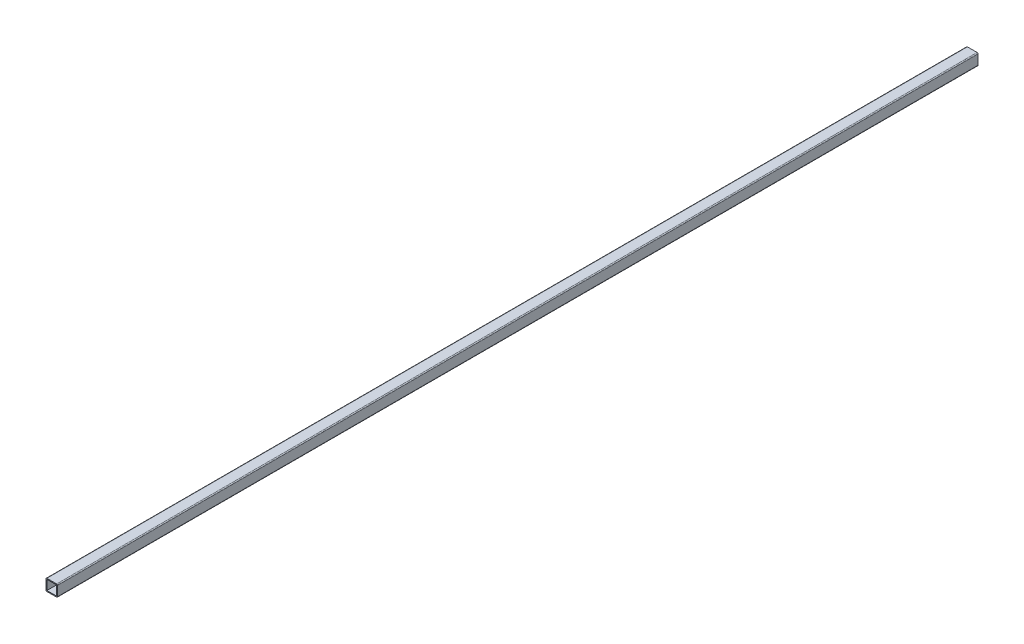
from build123d import *

# Parameters (mm, degrees)
SKETCH_1_W      = 21
SKETCH_1_H      = 21
EXTRUDE_1_DEPTH = 2000


with BuildPart() as part:
    # Sketch 1 → Extrude 1 (new body)
    with BuildSketch(Plane.XY):
        with BuildLine():
            Line((-2, 0), (-23, 0))
            ThreePointArc((-23, 0), (-24.414213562, -0.585786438), (-25, -2))
            Line((-25, -2), (-25, -23))
            ThreePointArc((-25, -23), (-24.414213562, -24.414213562), (-23, -25))
            Line((-23, -25), (-2, -25))
            ThreePointArc((-2, -25), (-0.585786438, -24.414213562), (0, -23))
            Line((0, -23), (0, -2))
            ThreePointArc((0, -2), (-0.585786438, -0.585786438), (-2, 0))
        make_face()
        with Locations((-12.5, -12.5)):
            Rectangle(SKETCH_1_W, SKETCH_1_H, mode=Mode.SUBTRACT)
    extrude(amount=EXTRUDE_1_DEPTH)


solid = part.part
